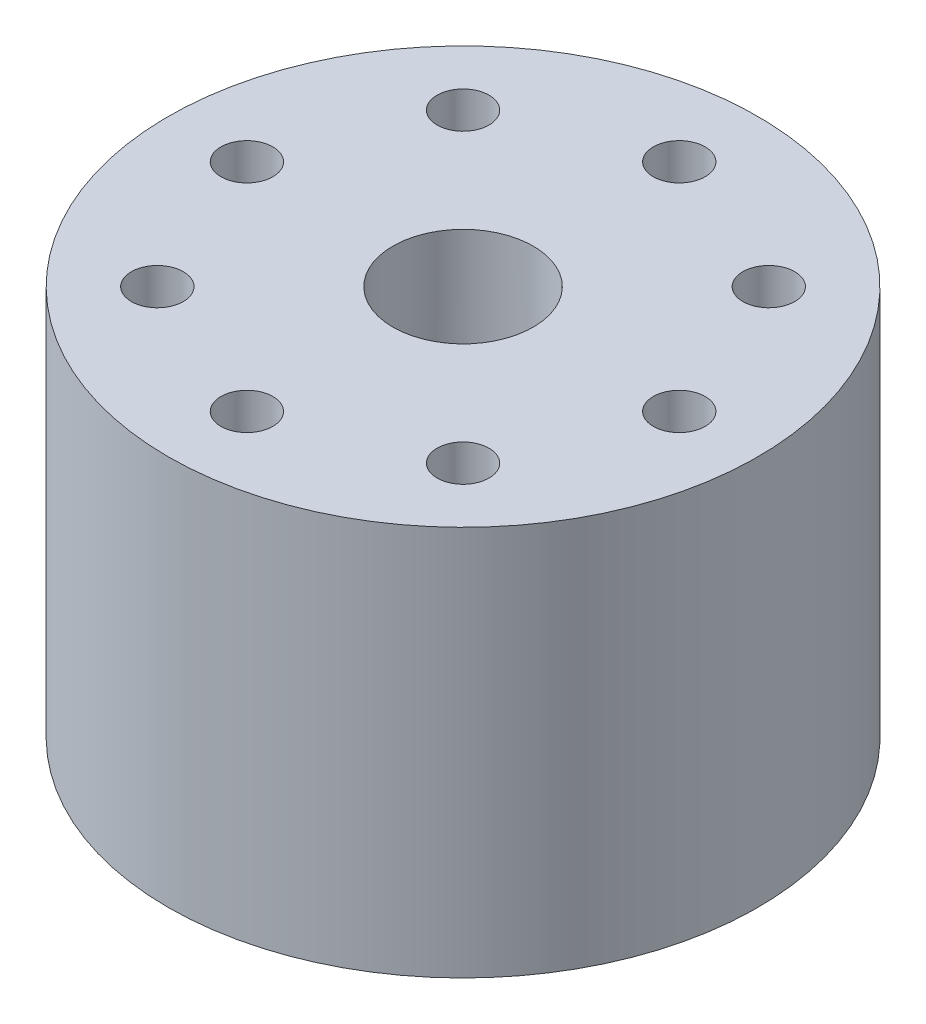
from build123d import *

# Parameters (mm, degrees)
SKETCH1_R                    = 37.5
OUTER_CYLINDER_DEPTH         = 49.65
SKETCH2_R                    = 8.93
NPT_HOLE_DEPTH               = 23
SKETCH3_R                    = 13
OUTER_LEAFLET_DIAMETER_DEPTH = 5
SKETCH4_R                    = 17
DEPTH_DEPTH                  = 3.15
SKETCH8_W                    = 13
SKETCH8_H                    = 5.04
SKETCH9_R                    = 3.3
BOLT_HOLES_DEPTH             = 73.647247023
CHAMFER3_SIZE                = 4
CHAMFER3_SIZE2               = 4.76701437


with BuildPart() as part:
    # Sketch1 → Outer Cylinder (new body)
    with BuildSketch(Plane(origin=(0, 0, 0), x_dir=(1, 0, 0), z_dir=(0, 1, 0))):
        with Locations(Location((0, 0, 0), (0, 0, 270))):
            Circle(SKETCH1_R)
    extrude(amount=OUTER_CYLINDER_DEPTH)

    # Sketch2 → NPT Hole (cut)
    with BuildSketch(Plane(origin=(0, 49.65, 0), x_dir=(1, 0, 0), z_dir=(0, 1, 0))):
        with Locations(Location((0, 0, 0), (0, 0, 270))):
            Circle(SKETCH2_R)
    extrude(amount=-NPT_HOLE_DEPTH, mode=Mode.SUBTRACT)

    # Sketch3 → Outer Leaflet Diameter (cut)
    with BuildSketch(Plane.XZ):
        with Locations(Location((0, 0, 0), (0, 0, 270))):
            Circle(SKETCH3_R)
    extrude(amount=-OUTER_LEAFLET_DIAMETER_DEPTH, mode=Mode.SUBTRACT)

    # Sketch4 → Depth (cut)
    with BuildSketch(Plane.XZ):
        with Locations(Location((0, 0, 0), (0, 0, 270))):
            Circle(SKETCH4_R)
    extrude(amount=-DEPTH_DEPTH, mode=Mode.SUBTRACT)

    # Sketch6 → Aortic Root (revolve, cut)
    with BuildSketch(Plane.XY):
        with BuildLine():
            Line((0, 3.15), (-13, 3.15))
            add(Edge.make_bspline(
                [(-13, 21.61), (-20.8, 12.38), (-13, 3.15)],
                knots=[0, 0, 0, 1, 1, 1], degree=2))
            Line((-13, 21.61), (0, 21.61))
            Line((0, 21.61), (0, 3.15))
        make_face()
    revolve(axis=Axis((0, 3.15, 0), (0, 1, 0)), mode=Mode.SUBTRACT)

    # Sketch8 → Ascending Aorta (revolve, cut)
    with BuildSketch(Plane.XY):
        with Locations((-6.5, 24.13)):
            Rectangle(SKETCH8_W, SKETCH8_H)
    revolve(axis=Axis((0, 26.65, 0), (0, -1, 0)), mode=Mode.SUBTRACT)

    # Sketch9 → Bolt Holes (cut, through all)
    with BuildSketch(Plane(origin=(0, 49.65, 0), x_dir=(1, 0, 0), z_dir=(0, 1, 0))):
        with Locations(Location((0, -27.5, 0), (0, 0, 270))):
            Circle(SKETCH9_R)
        with Locations(Location((-19.445436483, -19.445436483, 0), (0, 0, 270))):
            Circle(SKETCH9_R)
        with Locations(Location((-27.5, 0, 0), (0, 0, 270))):
            Circle(SKETCH9_R)
        with Locations(Location((-19.445436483, 19.445436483, 0), (0, 0, 270))):
            Circle(SKETCH9_R)
        with Locations(Location((0, 27.5, 0), (0, 0, 270))):
            Circle(SKETCH9_R)
        with Locations(Location((19.445436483, 19.445436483, 0), (0, 0, 270))):
            Circle(SKETCH9_R)
        with Locations(Location((27.5, 0, 0), (0, 0, 270))):
            Circle(SKETCH9_R)
        with Locations(Location((19.445436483, -19.445436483, 0), (0, 0, 270))):
            Circle(SKETCH9_R)
    extrude(amount=-BOLT_HOLES_DEPTH, mode=Mode.SUBTRACT)

    # Chamfer3
    chamfer3_edges = [part.edges().sort_by_distance(p)[0] for p in [
        (0, 26.65, -8.93),
    ]]
    chamfer3_side = [part.faces().sort_by_distance(p)[0] for p in [
        (12.632304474, 26.65, 0),
    ]]
    chamfer(chamfer3_edges, length=CHAMFER3_SIZE, length2=CHAMFER3_SIZE2, reference=chamfer3_side[0])


solid = part.part
